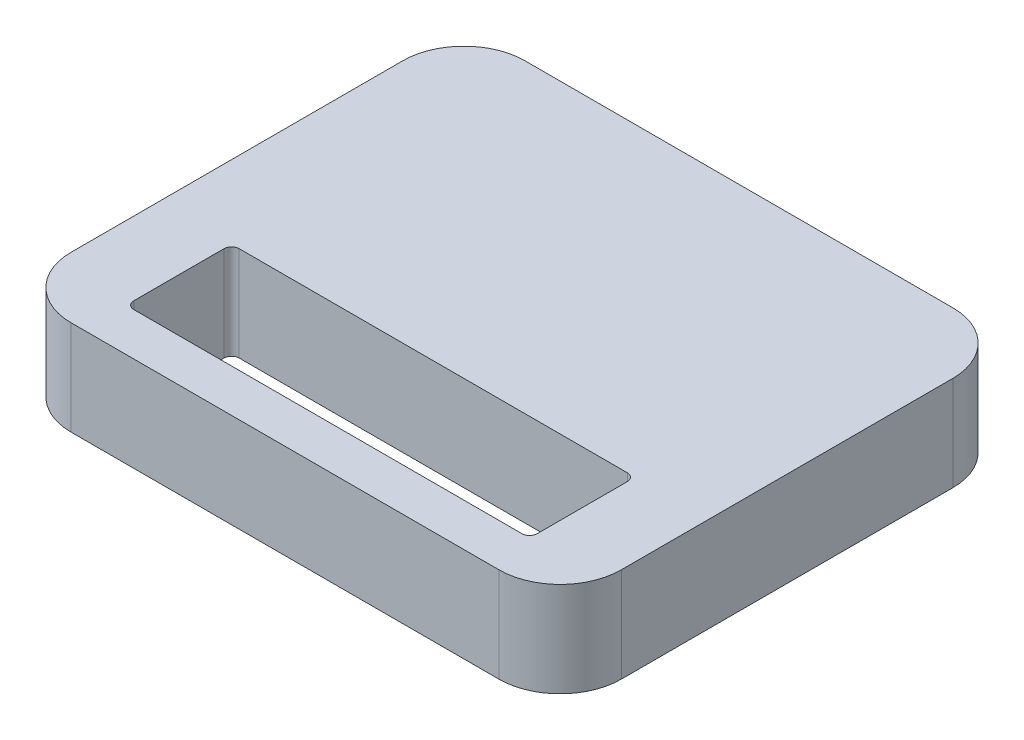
ISO-10303-21;
HEADER;
FILE_DESCRIPTION(('STEP AP214'),'2;1');
FILE_NAME('part.step','',(''),(''),'','','');
FILE_SCHEMA(('AUTOMOTIVE_DESIGN { 1 0 10303 214 1 1 1 1 }'));
ENDSEC;
DATA;
#1=APPLICATION_CONTEXT('core data for automotive mechanical design processes');
#2=APPLICATION_PROTOCOL_DEFINITION('international standard','automotive_design',2000,#1);
#3=PRODUCT_CONTEXT('',#1,'mechanical');
#4=PRODUCT('Part','Part','',(#3));
#5=PRODUCT_RELATED_PRODUCT_CATEGORY('part','',(#4));
#6=PRODUCT_DEFINITION_FORMATION('','',#4);
#7=PRODUCT_DEFINITION_CONTEXT('part definition',#1,'design');
#8=PRODUCT_DEFINITION('design','',#6,#7);
#9=PRODUCT_DEFINITION_SHAPE('','',#8);
#10=(LENGTH_UNIT() NAMED_UNIT(*) SI_UNIT(.MILLI.,.METRE.));
#11=(NAMED_UNIT(*) PLANE_ANGLE_UNIT() SI_UNIT($,.RADIAN.));
#12=(NAMED_UNIT(*) SI_UNIT($,.STERADIAN.) SOLID_ANGLE_UNIT());
#13=UNCERTAINTY_MEASURE_WITH_UNIT(LENGTH_MEASURE(1.E-05),#10,'distance_accuracy_value','');
#14=(GEOMETRIC_REPRESENTATION_CONTEXT(3) GLOBAL_UNCERTAINTY_ASSIGNED_CONTEXT((#13)) GLOBAL_UNIT_ASSIGNED_CONTEXT((#10,
#11,#12)) REPRESENTATION_CONTEXT('',''));
#15=CARTESIAN_POINT('',(0.,0.,0.));
#16=DIRECTION('',(0.,0.,1.));
#17=DIRECTION('',(1.,0.,0.));
#18=AXIS2_PLACEMENT_3D('',#15,#16,#17);
#19=CARTESIAN_POINT('',(0.,6.2,0.));
#20=DIRECTION('',(0.,1.,0.));
#21=DIRECTION('',(0.,0.,1.));
#22=AXIS2_PLACEMENT_3D('',#19,#20,#21);
#23=PLANE('',#22);
#24=DIRECTION('',(0.,0.,-1.));
#25=VECTOR('',#24,1.);
#26=CARTESIAN_POINT('',(18.,6.2,-23.45));
#27=LINE('',#26,#25);
#28=CARTESIAN_POINT('',(18.,6.2,2.25));
#29=VERTEX_POINT('',#28);
#30=CARTESIAN_POINT('',(18.,6.2,-19.45));
#31=VERTEX_POINT('',#30);
#32=EDGE_CURVE('E329',#29,#31,#27,.T.);
#33=ORIENTED_EDGE('',*,*,#32,.T.);
#34=CARTESIAN_POINT('',(14.,6.2,-19.45));
#35=DIRECTION('',(0.,1.,0.));
#36=DIRECTION('',(0.,0.,1.));
#37=AXIS2_PLACEMENT_3D('',#34,#35,#36);
#38=CIRCLE('',#37,4.);
#39=CARTESIAN_POINT('',(14.,6.2,-23.45));
#40=VERTEX_POINT('',#39);
#41=EDGE_CURVE('E222',#31,#40,#38,.T.);
#42=ORIENTED_EDGE('',*,*,#41,.T.);
#43=DIRECTION('',(-1.,0.,0.));
#44=VECTOR('',#43,1.);
#45=CARTESIAN_POINT('',(-18.,6.2,-23.45));
#46=LINE('',#45,#44);
#47=CARTESIAN_POINT('',(-14.,6.2,-23.45));
#48=VERTEX_POINT('',#47);
#49=EDGE_CURVE('E178',#40,#48,#46,.T.);
#50=ORIENTED_EDGE('',*,*,#49,.T.);
#51=CARTESIAN_POINT('',(-14.,6.2,-19.45));
#52=DIRECTION('',(0.,1.,0.));
#53=DIRECTION('',(0.,0.,1.));
#54=AXIS2_PLACEMENT_3D('',#51,#52,#53);
#55=CIRCLE('',#54,4.);
#56=CARTESIAN_POINT('',(-18.,6.2,-19.45));
#57=VERTEX_POINT('',#56);
#58=EDGE_CURVE('E213',#48,#57,#55,.T.);
#59=ORIENTED_EDGE('',*,*,#58,.T.);
#60=DIRECTION('',(0.,0.,1.));
#61=VECTOR('',#60,1.);
#62=CARTESIAN_POINT('',(-18.,6.2,-23.45));
#63=LINE('',#62,#61);
#64=CARTESIAN_POINT('',(-18.,6.2,2.25));
#65=VERTEX_POINT('',#64);
#66=EDGE_CURVE('E187',#57,#65,#63,.T.);
#67=ORIENTED_EDGE('',*,*,#66,.T.);
#68=CARTESIAN_POINT('',(-14.,6.2,2.25));
#69=DIRECTION('',(0.,1.,0.));
#70=DIRECTION('',(0.,0.,1.));
#71=AXIS2_PLACEMENT_3D('',#68,#69,#70);
#72=CIRCLE('',#71,4.);
#73=CARTESIAN_POINT('',(-14.,6.2,6.25));
#74=VERTEX_POINT('',#73);
#75=EDGE_CURVE('E216',#65,#74,#72,.T.);
#76=ORIENTED_EDGE('',*,*,#75,.T.);
#77=DIRECTION('',(1.,0.,0.));
#78=VECTOR('',#77,1.);
#79=CARTESIAN_POINT('',(-18.,6.2,6.25));
#80=LINE('',#79,#78);
#81=CARTESIAN_POINT('',(14.,6.2,6.25));
#82=VERTEX_POINT('',#81);
#83=EDGE_CURVE('E193',#74,#82,#80,.T.);
#84=ORIENTED_EDGE('',*,*,#83,.T.);
#85=CARTESIAN_POINT('',(14.,6.2,2.25));
#86=DIRECTION('',(0.,1.,0.));
#87=DIRECTION('',(0.,0.,1.));
#88=AXIS2_PLACEMENT_3D('',#85,#86,#87);
#89=CIRCLE('',#88,4.);
#90=EDGE_CURVE('E219',#82,#29,#89,.T.);
#91=ORIENTED_EDGE('',*,*,#90,.T.);
#92=EDGE_LOOP('',(#33,#42,#50,#59,#67,#76,#84,#91));
#93=FACE_BOUND('',#92,.T.);
#94=DIRECTION('',(-1.,0.,0.));
#95=VECTOR('',#94,1.);
#96=CARTESIAN_POINT('',(13.2,6.2,-3.45));
#97=LINE('',#96,#95);
#98=CARTESIAN_POINT('',(12.7,6.2,-3.45));
#99=VERTEX_POINT('',#98);
#100=CARTESIAN_POINT('',(-12.7,6.2,-3.45));
#101=VERTEX_POINT('',#100);
#102=EDGE_CURVE('E301',#99,#101,#97,.T.);
#103=ORIENTED_EDGE('',*,*,#102,.F.);
#104=CARTESIAN_POINT('',(12.7,6.2,-2.95));
#105=DIRECTION('',(0.,1.,0.));
#106=DIRECTION('',(0.,0.,1.));
#107=AXIS2_PLACEMENT_3D('',#104,#105,#106);
#108=CIRCLE('',#107,0.5);
#109=CARTESIAN_POINT('',(13.2,6.2,-2.95));
#110=VERTEX_POINT('',#109);
#111=EDGE_CURVE('E281',#99,#110,#108,.F.);
#112=ORIENTED_EDGE('',*,*,#111,.T.);
#113=DIRECTION('',(0.,0.,-1.));
#114=VECTOR('',#113,1.);
#115=CARTESIAN_POINT('',(13.2,6.2,3.45));
#116=LINE('',#115,#114);
#117=CARTESIAN_POINT('',(13.2,6.2,2.95));
#118=VERTEX_POINT('',#117);
#119=EDGE_CURVE('E305',#118,#110,#116,.T.);
#120=ORIENTED_EDGE('',*,*,#119,.F.);
#121=CARTESIAN_POINT('',(12.7,6.2,2.95));
#122=DIRECTION('',(0.,1.,0.));
#123=DIRECTION('',(0.,0.,1.));
#124=AXIS2_PLACEMENT_3D('',#121,#122,#123);
#125=CIRCLE('',#124,0.5);
#126=CARTESIAN_POINT('',(12.7,6.2,3.45));
#127=VERTEX_POINT('',#126);
#128=EDGE_CURVE('E275',#118,#127,#125,.F.);
#129=ORIENTED_EDGE('',*,*,#128,.T.);
#130=DIRECTION('',(1.,0.,0.));
#131=VECTOR('',#130,1.);
#132=CARTESIAN_POINT('',(13.2,6.2,3.45));
#133=LINE('',#132,#131);
#134=CARTESIAN_POINT('',(-12.7,6.2,3.45));
#135=VERTEX_POINT('',#134);
#136=EDGE_CURVE('E309',#135,#127,#133,.T.);
#137=ORIENTED_EDGE('',*,*,#136,.F.);
#138=CARTESIAN_POINT('',(-12.7,6.2,2.95));
#139=DIRECTION('',(0.,1.,0.));
#140=DIRECTION('',(0.,0.,1.));
#141=AXIS2_PLACEMENT_3D('',#138,#139,#140);
#142=CIRCLE('',#141,0.5);
#143=CARTESIAN_POINT('',(-13.2,6.2,2.95));
#144=VERTEX_POINT('',#143);
#145=EDGE_CURVE('E269',#135,#144,#142,.F.);
#146=ORIENTED_EDGE('',*,*,#145,.T.);
#147=DIRECTION('',(0.,0.,1.));
#148=VECTOR('',#147,1.);
#149=CARTESIAN_POINT('',(-13.2,6.2,3.45));
#150=LINE('',#149,#148);
#151=CARTESIAN_POINT('',(-13.2,6.2,-2.95));
#152=VERTEX_POINT('',#151);
#153=EDGE_CURVE('E304',#152,#144,#150,.T.);
#154=ORIENTED_EDGE('',*,*,#153,.F.);
#155=CARTESIAN_POINT('',(-12.7,6.2,-2.95));
#156=DIRECTION('',(0.,1.,0.));
#157=DIRECTION('',(0.,0.,1.));
#158=AXIS2_PLACEMENT_3D('',#155,#156,#157);
#159=CIRCLE('',#158,0.5);
#160=EDGE_CURVE('E11',#152,#101,#159,.F.);
#161=ORIENTED_EDGE('',*,*,#160,.T.);
#162=EDGE_LOOP('',(#103,#112,#120,#129,#137,#146,#154,#161));
#163=FACE_BOUND('',#162,.T.);
#164=ADVANCED_FACE('F43',(#93,#163),#23,.T.);
#165=CARTESIAN_POINT('',(0.,0.,0.));
#166=DIRECTION('',(0.,1.,0.));
#167=DIRECTION('',(0.,0.,1.));
#168=AXIS2_PLACEMENT_3D('',#165,#166,#167);
#169=PLANE('',#168);
#170=DIRECTION('',(-1.,0.,0.));
#171=VECTOR('',#170,1.);
#172=CARTESIAN_POINT('',(-18.,0.,-23.45));
#173=LINE('',#172,#171);
#174=CARTESIAN_POINT('',(14.,0.,-23.45));
#175=VERTEX_POINT('',#174);
#176=CARTESIAN_POINT('',(-14.,0.,-23.45));
#177=VERTEX_POINT('',#176);
#178=EDGE_CURVE('E175',#175,#177,#173,.T.);
#179=ORIENTED_EDGE('',*,*,#178,.F.);
#180=CARTESIAN_POINT('',(14.,0.,-19.45));
#181=DIRECTION('',(0.,1.,0.));
#182=DIRECTION('',(0.,0.,1.));
#183=AXIS2_PLACEMENT_3D('',#180,#181,#182);
#184=CIRCLE('',#183,4.);
#185=CARTESIAN_POINT('',(18.,0.,-19.45));
#186=VERTEX_POINT('',#185);
#187=EDGE_CURVE('E157',#175,#186,#184,.F.);
#188=ORIENTED_EDGE('',*,*,#187,.T.);
#189=DIRECTION('',(0.,0.,-1.));
#190=VECTOR('',#189,1.);
#191=CARTESIAN_POINT('',(18.,0.,-23.45));
#192=LINE('',#191,#190);
#193=CARTESIAN_POINT('',(18.,0.,2.25));
#194=VERTEX_POINT('',#193);
#195=EDGE_CURVE('E188',#194,#186,#192,.T.);
#196=ORIENTED_EDGE('',*,*,#195,.F.);
#197=CARTESIAN_POINT('',(14.,0.,2.25));
#198=DIRECTION('',(0.,1.,0.));
#199=DIRECTION('',(0.,0.,1.));
#200=AXIS2_PLACEMENT_3D('',#197,#198,#199);
#201=CIRCLE('',#200,4.);
#202=CARTESIAN_POINT('',(14.,0.,6.25));
#203=VERTEX_POINT('',#202);
#204=EDGE_CURVE('E169',#194,#203,#201,.F.);
#205=ORIENTED_EDGE('',*,*,#204,.T.);
#206=DIRECTION('',(1.,0.,0.));
#207=VECTOR('',#206,1.);
#208=CARTESIAN_POINT('',(-18.,0.,6.25));
#209=LINE('',#208,#207);
#210=CARTESIAN_POINT('',(-14.,0.,6.25));
#211=VERTEX_POINT('',#210);
#212=EDGE_CURVE('E195',#211,#203,#209,.T.);
#213=ORIENTED_EDGE('',*,*,#212,.F.);
#214=CARTESIAN_POINT('',(-14.,0.,2.25));
#215=DIRECTION('',(0.,1.,0.));
#216=DIRECTION('',(0.,0.,1.));
#217=AXIS2_PLACEMENT_3D('',#214,#215,#216);
#218=CIRCLE('',#217,4.);
#219=CARTESIAN_POINT('',(-18.,0.,2.25));
#220=VERTEX_POINT('',#219);
#221=EDGE_CURVE('E203',#211,#220,#218,.F.);
#222=ORIENTED_EDGE('',*,*,#221,.T.);
#223=DIRECTION('',(0.,0.,1.));
#224=VECTOR('',#223,1.);
#225=CARTESIAN_POINT('',(-18.,0.,-23.45));
#226=LINE('',#225,#224);
#227=CARTESIAN_POINT('',(-18.,0.,-19.45));
#228=VERTEX_POINT('',#227);
#229=EDGE_CURVE('E317',#228,#220,#226,.T.);
#230=ORIENTED_EDGE('',*,*,#229,.F.);
#231=CARTESIAN_POINT('',(-14.,0.,-19.45));
#232=DIRECTION('',(0.,1.,0.));
#233=DIRECTION('',(0.,0.,1.));
#234=AXIS2_PLACEMENT_3D('',#231,#232,#233);
#235=CIRCLE('',#234,4.);
#236=EDGE_CURVE('E180',#228,#177,#235,.F.);
#237=ORIENTED_EDGE('',*,*,#236,.T.);
#238=EDGE_LOOP('',(#179,#188,#196,#205,#213,#222,#230,#237));
#239=FACE_BOUND('',#238,.T.);
#240=DIRECTION('',(1.,0.,0.));
#241=VECTOR('',#240,1.);
#242=CARTESIAN_POINT('',(13.2,0.,3.45));
#243=LINE('',#242,#241);
#244=CARTESIAN_POINT('',(-12.7,0.,3.45));
#245=VERTEX_POINT('',#244);
#246=CARTESIAN_POINT('',(12.7,0.,3.45));
#247=VERTEX_POINT('',#246);
#248=EDGE_CURVE('E298',#245,#247,#243,.T.);
#249=ORIENTED_EDGE('',*,*,#248,.T.);
#250=CARTESIAN_POINT('',(12.7,0.,2.95));
#251=DIRECTION('',(0.,1.,0.));
#252=DIRECTION('',(0.,0.,1.));
#253=AXIS2_PLACEMENT_3D('',#250,#251,#252);
#254=CIRCLE('',#253,0.5);
#255=CARTESIAN_POINT('',(13.2,0.,2.95));
#256=VERTEX_POINT('',#255);
#257=EDGE_CURVE('E272',#247,#256,#254,.T.);
#258=ORIENTED_EDGE('',*,*,#257,.T.);
#259=DIRECTION('',(0.,0.,-1.));
#260=VECTOR('',#259,1.);
#261=CARTESIAN_POINT('',(13.2,0.,3.45));
#262=LINE('',#261,#260);
#263=CARTESIAN_POINT('',(13.2,0.,-2.95));
#264=VERTEX_POINT('',#263);
#265=EDGE_CURVE('E318',#256,#264,#262,.T.);
#266=ORIENTED_EDGE('',*,*,#265,.T.);
#267=CARTESIAN_POINT('',(12.7,0.,-2.95));
#268=DIRECTION('',(0.,1.,0.));
#269=DIRECTION('',(0.,0.,1.));
#270=AXIS2_PLACEMENT_3D('',#267,#268,#269);
#271=CIRCLE('',#270,0.5);
#272=CARTESIAN_POINT('',(12.7,0.,-3.45));
#273=VERTEX_POINT('',#272);
#274=EDGE_CURVE('E278',#264,#273,#271,.T.);
#275=ORIENTED_EDGE('',*,*,#274,.T.);
#276=DIRECTION('',(-1.,0.,0.));
#277=VECTOR('',#276,1.);
#278=CARTESIAN_POINT('',(13.2,0.,-3.45));
#279=LINE('',#278,#277);
#280=CARTESIAN_POINT('',(-12.7,0.,-3.45));
#281=VERTEX_POINT('',#280);
#282=EDGE_CURVE('E289',#273,#281,#279,.T.);
#283=ORIENTED_EDGE('',*,*,#282,.T.);
#284=CARTESIAN_POINT('',(-12.7,0.,-2.95));
#285=DIRECTION('',(0.,1.,0.));
#286=DIRECTION('',(0.,0.,1.));
#287=AXIS2_PLACEMENT_3D('',#284,#285,#286);
#288=CIRCLE('',#287,0.5);
#289=CARTESIAN_POINT('',(-13.2,0.,-2.95));
#290=VERTEX_POINT('',#289);
#291=EDGE_CURVE('E52',#281,#290,#288,.T.);
#292=ORIENTED_EDGE('',*,*,#291,.T.);
#293=DIRECTION('',(0.,0.,1.));
#294=VECTOR('',#293,1.);
#295=CARTESIAN_POINT('',(-13.2,0.,3.45));
#296=LINE('',#295,#294);
#297=CARTESIAN_POINT('',(-13.2,0.,2.95));
#298=VERTEX_POINT('',#297);
#299=EDGE_CURVE('E288',#290,#298,#296,.T.);
#300=ORIENTED_EDGE('',*,*,#299,.T.);
#301=CARTESIAN_POINT('',(-12.7,0.,2.95));
#302=DIRECTION('',(0.,1.,0.));
#303=DIRECTION('',(0.,0.,1.));
#304=AXIS2_PLACEMENT_3D('',#301,#302,#303);
#305=CIRCLE('',#304,0.5);
#306=EDGE_CURVE('E266',#298,#245,#305,.T.);
#307=ORIENTED_EDGE('',*,*,#306,.T.);
#308=EDGE_LOOP('',(#249,#258,#266,#275,#283,#292,#300,#307));
#309=FACE_BOUND('',#308,.T.);
#310=ADVANCED_FACE('F183',(#239,#309),#169,.F.);
#311=CARTESIAN_POINT('',(-18.,6.2,-23.45));
#312=DIRECTION('',(1.,0.,0.));
#313=DIRECTION('',(0.,0.,-1.));
#314=AXIS2_PLACEMENT_3D('',#311,#312,#313);
#315=PLANE('',#314);
#316=ORIENTED_EDGE('',*,*,#229,.T.);
#317=DIRECTION('',(0.,-1.,0.));
#318=VECTOR('',#317,1.);
#319=CARTESIAN_POINT('',(-18.,6.2,2.25));
#320=LINE('',#319,#318);
#321=EDGE_CURVE('E236',#220,#65,#320,.F.);
#322=ORIENTED_EDGE('',*,*,#321,.T.);
#323=ORIENTED_EDGE('',*,*,#66,.F.);
#324=DIRECTION('',(0.,-1.,0.));
#325=VECTOR('',#324,1.);
#326=CARTESIAN_POINT('',(-18.,6.2,-19.45));
#327=LINE('',#326,#325);
#328=EDGE_CURVE('E232',#57,#228,#327,.T.);
#329=ORIENTED_EDGE('',*,*,#328,.T.);
#330=EDGE_LOOP('',(#316,#322,#323,#329));
#331=FACE_BOUND('',#330,.T.);
#332=ADVANCED_FACE('F361',(#331),#315,.F.);
#333=CARTESIAN_POINT('',(-18.,6.2,6.25));
#334=DIRECTION('',(0.,0.,-1.));
#335=DIRECTION('',(-1.,0.,0.));
#336=AXIS2_PLACEMENT_3D('',#333,#334,#335);
#337=PLANE('',#336);
#338=ORIENTED_EDGE('',*,*,#212,.T.);
#339=DIRECTION('',(0.,-1.,0.));
#340=VECTOR('',#339,1.);
#341=CARTESIAN_POINT('',(14.,6.2,6.25));
#342=LINE('',#341,#340);
#343=EDGE_CURVE('E229',#203,#82,#342,.F.);
#344=ORIENTED_EDGE('',*,*,#343,.T.);
#345=ORIENTED_EDGE('',*,*,#83,.F.);
#346=DIRECTION('',(0.,-1.,0.));
#347=VECTOR('',#346,1.);
#348=CARTESIAN_POINT('',(-14.,6.2,6.25));
#349=LINE('',#348,#347);
#350=EDGE_CURVE('E225',#74,#211,#349,.T.);
#351=ORIENTED_EDGE('',*,*,#350,.T.);
#352=EDGE_LOOP('',(#338,#344,#345,#351));
#353=FACE_BOUND('',#352,.T.);
#354=ADVANCED_FACE('F342',(#353),#337,.F.);
#355=CARTESIAN_POINT('',(18.,6.2,-23.45));
#356=DIRECTION('',(-1.,0.,0.));
#357=DIRECTION('',(0.,0.,1.));
#358=AXIS2_PLACEMENT_3D('',#355,#356,#357);
#359=PLANE('',#358);
#360=ORIENTED_EDGE('',*,*,#195,.T.);
#361=DIRECTION('',(0.,-1.,0.));
#362=VECTOR('',#361,1.);
#363=CARTESIAN_POINT('',(18.,6.2,-19.45));
#364=LINE('',#363,#362);
#365=EDGE_CURVE('E162',#186,#31,#364,.F.);
#366=ORIENTED_EDGE('',*,*,#365,.T.);
#367=ORIENTED_EDGE('',*,*,#32,.F.);
#368=DIRECTION('',(0.,-1.,0.));
#369=VECTOR('',#368,1.);
#370=CARTESIAN_POINT('',(18.,6.2,2.25));
#371=LINE('',#370,#369);
#372=EDGE_CURVE('E168',#29,#194,#371,.T.);
#373=ORIENTED_EDGE('',*,*,#372,.T.);
#374=EDGE_LOOP('',(#360,#366,#367,#373));
#375=FACE_BOUND('',#374,.T.);
#376=ADVANCED_FACE('F352',(#375),#359,.F.);
#377=CARTESIAN_POINT('',(-18.,6.2,-23.45));
#378=DIRECTION('',(0.,0.,1.));
#379=DIRECTION('',(1.,0.,0.));
#380=AXIS2_PLACEMENT_3D('',#377,#378,#379);
#381=PLANE('',#380);
#382=ORIENTED_EDGE('',*,*,#49,.F.);
#383=DIRECTION('',(0.,-1.,0.));
#384=VECTOR('',#383,1.);
#385=CARTESIAN_POINT('',(14.,6.2,-23.45));
#386=LINE('',#385,#384);
#387=EDGE_CURVE('E161',#40,#175,#386,.T.);
#388=ORIENTED_EDGE('',*,*,#387,.T.);
#389=ORIENTED_EDGE('',*,*,#178,.T.);
#390=DIRECTION('',(0.,-1.,0.));
#391=VECTOR('',#390,1.);
#392=CARTESIAN_POINT('',(-14.,6.2,-23.45));
#393=LINE('',#392,#391);
#394=EDGE_CURVE('E181',#177,#48,#393,.F.);
#395=ORIENTED_EDGE('',*,*,#394,.T.);
#396=EDGE_LOOP('',(#382,#388,#389,#395));
#397=FACE_BOUND('',#396,.T.);
#398=ADVANCED_FACE('F174',(#397),#381,.F.);
#399=CARTESIAN_POINT('',(13.2,6.2,3.45));
#400=DIRECTION('',(-1.,0.,0.));
#401=DIRECTION('',(0.,0.,1.));
#402=AXIS2_PLACEMENT_3D('',#399,#400,#401);
#403=PLANE('',#402);
#404=ORIENTED_EDGE('',*,*,#265,.F.);
#405=DIRECTION('',(0.,-1.,0.));
#406=VECTOR('',#405,1.);
#407=CARTESIAN_POINT('',(13.2,6.2,2.95));
#408=LINE('',#407,#406);
#409=EDGE_CURVE('E257',#256,#118,#408,.F.);
#410=ORIENTED_EDGE('',*,*,#409,.T.);
#411=ORIENTED_EDGE('',*,*,#119,.T.);
#412=DIRECTION('',(0.,-1.,0.));
#413=VECTOR('',#412,1.);
#414=CARTESIAN_POINT('',(13.2,0.,-2.95));
#415=LINE('',#414,#413);
#416=EDGE_CURVE('E253',#110,#264,#415,.T.);
#417=ORIENTED_EDGE('',*,*,#416,.T.);
#418=EDGE_LOOP('',(#404,#410,#411,#417));
#419=FACE_BOUND('',#418,.T.);
#420=ADVANCED_FACE('F359',(#419),#403,.T.);
#421=CARTESIAN_POINT('',(13.2,6.2,-3.45));
#422=DIRECTION('',(0.,0.,1.));
#423=DIRECTION('',(1.,0.,0.));
#424=AXIS2_PLACEMENT_3D('',#421,#422,#423);
#425=PLANE('',#424);
#426=ORIENTED_EDGE('',*,*,#282,.F.);
#427=DIRECTION('',(0.,-1.,0.));
#428=VECTOR('',#427,1.);
#429=CARTESIAN_POINT('',(12.7,6.2,-3.45));
#430=LINE('',#429,#428);
#431=EDGE_CURVE('E64',#273,#99,#430,.F.);
#432=ORIENTED_EDGE('',*,*,#431,.T.);
#433=ORIENTED_EDGE('',*,*,#102,.T.);
#434=DIRECTION('',(0.,-1.,0.));
#435=VECTOR('',#434,1.);
#436=CARTESIAN_POINT('',(-12.7,0.,-3.45));
#437=LINE('',#436,#435);
#438=EDGE_CURVE('E260',#101,#281,#437,.T.);
#439=ORIENTED_EDGE('',*,*,#438,.T.);
#440=EDGE_LOOP('',(#426,#432,#433,#439));
#441=FACE_BOUND('',#440,.T.);
#442=ADVANCED_FACE('F300',(#441),#425,.T.);
#443=CARTESIAN_POINT('',(-13.2,6.2,3.45));
#444=DIRECTION('',(1.,0.,0.));
#445=DIRECTION('',(0.,0.,-1.));
#446=AXIS2_PLACEMENT_3D('',#443,#444,#445);
#447=PLANE('',#446);
#448=ORIENTED_EDGE('',*,*,#153,.T.);
#449=DIRECTION('',(0.,-1.,0.));
#450=VECTOR('',#449,1.);
#451=CARTESIAN_POINT('',(-13.2,0.,2.95));
#452=LINE('',#451,#450);
#453=EDGE_CURVE('E242',#144,#298,#452,.T.);
#454=ORIENTED_EDGE('',*,*,#453,.T.);
#455=ORIENTED_EDGE('',*,*,#299,.F.);
#456=DIRECTION('',(0.,-1.,0.));
#457=VECTOR('',#456,1.);
#458=CARTESIAN_POINT('',(-13.2,6.2,-2.95));
#459=LINE('',#458,#457);
#460=EDGE_CURVE('E239',#290,#152,#459,.F.);
#461=ORIENTED_EDGE('',*,*,#460,.T.);
#462=EDGE_LOOP('',(#448,#454,#455,#461));
#463=FACE_BOUND('',#462,.T.);
#464=ADVANCED_FACE('F295',(#463),#447,.T.);
#465=CARTESIAN_POINT('',(13.2,6.2,3.45));
#466=DIRECTION('',(0.,0.,-1.));
#467=DIRECTION('',(-1.,0.,0.));
#468=AXIS2_PLACEMENT_3D('',#465,#466,#467);
#469=PLANE('',#468);
#470=ORIENTED_EDGE('',*,*,#248,.F.);
#471=DIRECTION('',(0.,-1.,0.));
#472=VECTOR('',#471,1.);
#473=CARTESIAN_POINT('',(-12.7,6.2,3.45));
#474=LINE('',#473,#472);
#475=EDGE_CURVE('E250',#245,#135,#474,.F.);
#476=ORIENTED_EDGE('',*,*,#475,.T.);
#477=ORIENTED_EDGE('',*,*,#136,.T.);
#478=DIRECTION('',(0.,-1.,0.));
#479=VECTOR('',#478,1.);
#480=CARTESIAN_POINT('',(12.7,0.,3.45));
#481=LINE('',#480,#479);
#482=EDGE_CURVE('E246',#127,#247,#481,.T.);
#483=ORIENTED_EDGE('',*,*,#482,.T.);
#484=EDGE_LOOP('',(#470,#476,#477,#483));
#485=FACE_BOUND('',#484,.T.);
#486=ADVANCED_FACE('F377',(#485),#469,.T.);
#487=CARTESIAN_POINT('',(14.,6.2,-19.45));
#488=DIRECTION('',(0.,-1.,0.));
#489=DIRECTION('',(0.,0.,-1.));
#490=AXIS2_PLACEMENT_3D('',#487,#488,#489);
#491=CYLINDRICAL_SURFACE('',#490,4.);
#492=ORIENTED_EDGE('',*,*,#41,.F.);
#493=ORIENTED_EDGE('',*,*,#365,.F.);
#494=ORIENTED_EDGE('',*,*,#187,.F.);
#495=ORIENTED_EDGE('',*,*,#387,.F.);
#496=EDGE_LOOP('',(#492,#493,#494,#495));
#497=FACE_BOUND('',#496,.T.);
#498=ADVANCED_FACE('F160',(#497),#491,.T.);
#499=CARTESIAN_POINT('',(14.,6.2,2.25));
#500=DIRECTION('',(0.,-1.,0.));
#501=DIRECTION('',(0.,0.,-1.));
#502=AXIS2_PLACEMENT_3D('',#499,#500,#501);
#503=CYLINDRICAL_SURFACE('',#502,4.);
#504=ORIENTED_EDGE('',*,*,#90,.F.);
#505=ORIENTED_EDGE('',*,*,#343,.F.);
#506=ORIENTED_EDGE('',*,*,#204,.F.);
#507=ORIENTED_EDGE('',*,*,#372,.F.);
#508=EDGE_LOOP('',(#504,#505,#506,#507));
#509=FACE_BOUND('',#508,.T.);
#510=ADVANCED_FACE('F347',(#509),#503,.T.);
#511=CARTESIAN_POINT('',(-14.,6.2,2.25));
#512=DIRECTION('',(0.,-1.,0.));
#513=DIRECTION('',(0.,0.,-1.));
#514=AXIS2_PLACEMENT_3D('',#511,#512,#513);
#515=CYLINDRICAL_SURFACE('',#514,4.);
#516=ORIENTED_EDGE('',*,*,#75,.F.);
#517=ORIENTED_EDGE('',*,*,#321,.F.);
#518=ORIENTED_EDGE('',*,*,#221,.F.);
#519=ORIENTED_EDGE('',*,*,#350,.F.);
#520=EDGE_LOOP('',(#516,#517,#518,#519));
#521=FACE_BOUND('',#520,.T.);
#522=ADVANCED_FACE('F412',(#521),#515,.T.);
#523=CARTESIAN_POINT('',(-14.,6.2,-19.45));
#524=DIRECTION('',(0.,-1.,0.));
#525=DIRECTION('',(0.,0.,-1.));
#526=AXIS2_PLACEMENT_3D('',#523,#524,#525);
#527=CYLINDRICAL_SURFACE('',#526,4.);
#528=ORIENTED_EDGE('',*,*,#58,.F.);
#529=ORIENTED_EDGE('',*,*,#394,.F.);
#530=ORIENTED_EDGE('',*,*,#236,.F.);
#531=ORIENTED_EDGE('',*,*,#328,.F.);
#532=EDGE_LOOP('',(#528,#529,#530,#531));
#533=FACE_BOUND('',#532,.T.);
#534=ADVANCED_FACE('F409',(#533),#527,.T.);
#535=CARTESIAN_POINT('',(-12.7,6.2,2.95));
#536=DIRECTION('',(0.,1.,0.));
#537=DIRECTION('',(0.,0.,1.));
#538=AXIS2_PLACEMENT_3D('',#535,#536,#537);
#539=CYLINDRICAL_SURFACE('',#538,0.5);
#540=ORIENTED_EDGE('',*,*,#145,.F.);
#541=ORIENTED_EDGE('',*,*,#475,.F.);
#542=ORIENTED_EDGE('',*,*,#306,.F.);
#543=ORIENTED_EDGE('',*,*,#453,.F.);
#544=EDGE_LOOP('',(#540,#541,#542,#543));
#545=FACE_BOUND('',#544,.T.);
#546=ADVANCED_FACE('F390',(#545),#539,.F.);
#547=CARTESIAN_POINT('',(12.7,6.2,2.95));
#548=DIRECTION('',(0.,1.,0.));
#549=DIRECTION('',(0.,0.,1.));
#550=AXIS2_PLACEMENT_3D('',#547,#548,#549);
#551=CYLINDRICAL_SURFACE('',#550,0.5);
#552=ORIENTED_EDGE('',*,*,#128,.F.);
#553=ORIENTED_EDGE('',*,*,#409,.F.);
#554=ORIENTED_EDGE('',*,*,#257,.F.);
#555=ORIENTED_EDGE('',*,*,#482,.F.);
#556=EDGE_LOOP('',(#552,#553,#554,#555));
#557=FACE_BOUND('',#556,.T.);
#558=ADVANCED_FACE('F394',(#557),#551,.F.);
#559=CARTESIAN_POINT('',(12.7,6.2,-2.95));
#560=DIRECTION('',(0.,1.,0.));
#561=DIRECTION('',(0.,0.,1.));
#562=AXIS2_PLACEMENT_3D('',#559,#560,#561);
#563=CYLINDRICAL_SURFACE('',#562,0.5);
#564=ORIENTED_EDGE('',*,*,#111,.F.);
#565=ORIENTED_EDGE('',*,*,#431,.F.);
#566=ORIENTED_EDGE('',*,*,#274,.F.);
#567=ORIENTED_EDGE('',*,*,#416,.F.);
#568=EDGE_LOOP('',(#564,#565,#566,#567));
#569=FACE_BOUND('',#568,.T.);
#570=ADVANCED_FACE('F399',(#569),#563,.F.);
#571=CARTESIAN_POINT('',(-12.7,6.2,-2.95));
#572=DIRECTION('',(0.,1.,0.));
#573=DIRECTION('',(0.,0.,1.));
#574=AXIS2_PLACEMENT_3D('',#571,#572,#573);
#575=CYLINDRICAL_SURFACE('',#574,0.5);
#576=ORIENTED_EDGE('',*,*,#160,.F.);
#577=ORIENTED_EDGE('',*,*,#460,.F.);
#578=ORIENTED_EDGE('',*,*,#291,.F.);
#579=ORIENTED_EDGE('',*,*,#438,.F.);
#580=EDGE_LOOP('',(#576,#577,#578,#579));
#581=FACE_BOUND('',#580,.T.);
#582=ADVANCED_FACE('F45',(#581),#575,.F.);
#583=CLOSED_SHELL('',(#164,#310,#332,#354,#376,#398,#420,#442,#464,#486,#498,#510,#522,#534,
#546,#558,#570,#582));
#584=MANIFOLD_SOLID_BREP('B2',#583);
#585=ADVANCED_BREP_SHAPE_REPRESENTATION('',(#18,#584),#14);
#586=SHAPE_DEFINITION_REPRESENTATION(#9,#585);
ENDSEC;
END-ISO-10303-21;
